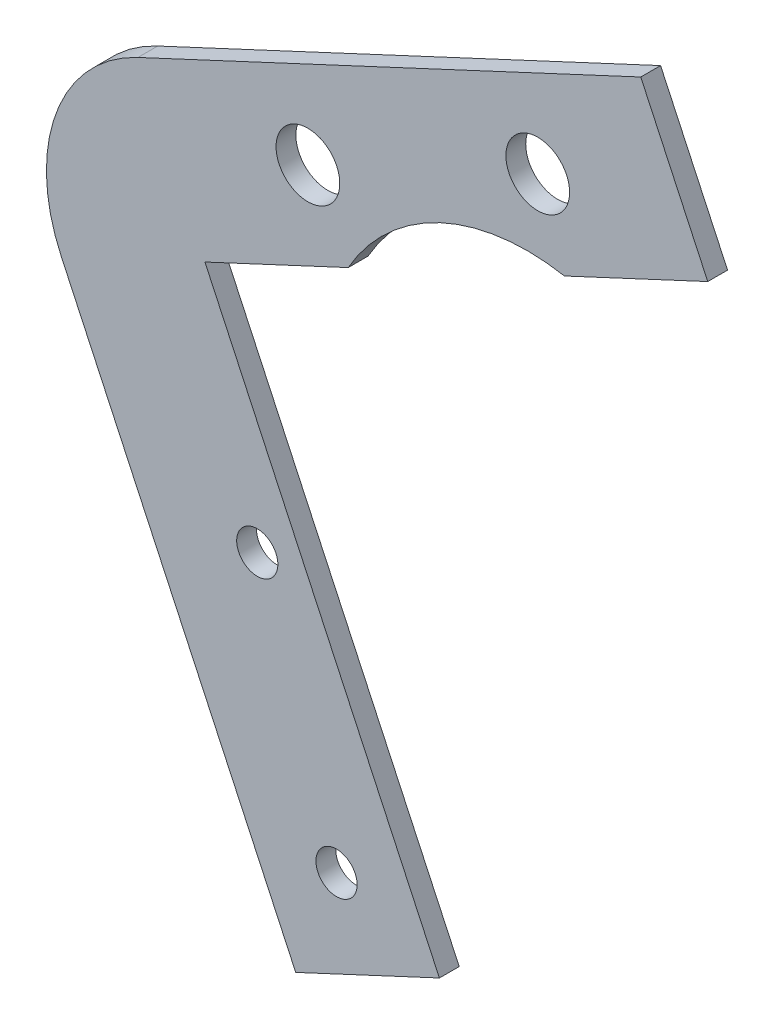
ISO-10303-21;
HEADER;
FILE_DESCRIPTION(('STEP AP214'),'2;1');
FILE_NAME('part.step','',(''),(''),'','','');
FILE_SCHEMA(('AUTOMOTIVE_DESIGN { 1 0 10303 214 1 1 1 1 }'));
ENDSEC;
DATA;
#1=APPLICATION_CONTEXT('core data for automotive mechanical design processes');
#2=APPLICATION_PROTOCOL_DEFINITION('international standard','automotive_design',2000,#1);
#3=PRODUCT_CONTEXT('',#1,'mechanical');
#4=PRODUCT('Part','Part','',(#3));
#5=PRODUCT_RELATED_PRODUCT_CATEGORY('part','',(#4));
#6=PRODUCT_DEFINITION_FORMATION('','',#4);
#7=PRODUCT_DEFINITION_CONTEXT('part definition',#1,'design');
#8=PRODUCT_DEFINITION('design','',#6,#7);
#9=PRODUCT_DEFINITION_SHAPE('','',#8);
#10=(LENGTH_UNIT() NAMED_UNIT(*) SI_UNIT(.MILLI.,.METRE.));
#11=(NAMED_UNIT(*) PLANE_ANGLE_UNIT() SI_UNIT($,.RADIAN.));
#12=(NAMED_UNIT(*) SI_UNIT($,.STERADIAN.) SOLID_ANGLE_UNIT());
#13=UNCERTAINTY_MEASURE_WITH_UNIT(LENGTH_MEASURE(1.E-05),#10,'distance_accuracy_value','');
#14=(GEOMETRIC_REPRESENTATION_CONTEXT(3) GLOBAL_UNCERTAINTY_ASSIGNED_CONTEXT((#13)) GLOBAL_UNIT_ASSIGNED_CONTEXT((#10,
#11,#12)) REPRESENTATION_CONTEXT('',''));
#15=CARTESIAN_POINT('',(0.,0.,0.));
#16=DIRECTION('',(0.,0.,1.));
#17=DIRECTION('',(1.,0.,0.));
#18=AXIS2_PLACEMENT_3D('',#15,#16,#17);
#19=CARTESIAN_POINT('',(24.8129176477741,37.4773565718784,1.58749999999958));
#20=DIRECTION('',(0.,0.,0.999999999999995));
#21=DIRECTION('',(0.999999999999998,0.,0.));
#22=AXIS2_PLACEMENT_3D('',#19,#20,#21);
#23=PLANE('',#22);
#24=CARTESIAN_POINT('',(25.6480917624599,59.726927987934,1.58750000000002));
#25=DIRECTION('',(0.,0.,0.999999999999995));
#26=DIRECTION('',(0.999999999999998,0.,0.));
#27=AXIS2_PLACEMENT_3D('',#24,#25,#26);
#28=CIRCLE('',#27,2.55269999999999);
#29=CARTESIAN_POINT('',(23.0953917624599,59.726927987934,1.58750000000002));
#30=VERTEX_POINT('',#29);
#31=EDGE_CURVE('E201',#30,#30,#28,.T.);
#32=ORIENTED_EDGE('',*,*,#31,.F.);
#33=EDGE_LOOP('',(#32));
#34=FACE_BOUND('',#33,.T.);
#35=CARTESIAN_POINT('',(3.17499999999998,22.2249999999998,1.58750000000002));
#36=DIRECTION('',(0.,0.,0.999999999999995));
#37=DIRECTION('',(0.999999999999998,0.,0.));
#38=AXIS2_PLACEMENT_3D('',#35,#36,#37);
#39=CIRCLE('',#38,1.651);
#40=CARTESIAN_POINT('',(1.52399999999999,22.2249999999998,1.58750000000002));
#41=VERTEX_POINT('',#40);
#42=EDGE_CURVE('E137',#41,#41,#39,.T.);
#43=ORIENTED_EDGE('',*,*,#42,.F.);
#44=EDGE_LOOP('',(#43));
#45=FACE_BOUND('',#44,.T.);
#46=DIRECTION('',(0.90630778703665,0.422618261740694,0.));
#47=VECTOR('',#46,1.);
#48=CARTESIAN_POINT('',(6.2562128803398,-5.36725192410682,1.58749999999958));
#49=LINE('',#48,#47);
#50=CARTESIAN_POINT('',(6.2562128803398,-5.36725192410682,1.58749999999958));
#51=VERTEX_POINT('',#50);
#52=CARTESIAN_POINT('',(17.7663217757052,0.,1.58749999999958));
#53=VERTEX_POINT('',#52);
#54=EDGE_CURVE('E150',#51,#53,#49,.T.);
#55=ORIENTED_EDGE('',*,*,#54,.T.);
#56=DIRECTION('',(-0.422618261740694,0.906307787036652,0.));
#57=VECTOR('',#56,1.);
#58=CARTESIAN_POINT('',(17.7663217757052,0.,1.58749999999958));
#59=LINE('',#58,#57);
#60=CARTESIAN_POINT('',(-1.01905995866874,40.2853811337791,1.58749999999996));
#61=VERTEX_POINT('',#60);
#62=EDGE_CURVE('E93',#53,#61,#59,.T.);
#63=ORIENTED_EDGE('',*,*,#62,.T.);
#64=DIRECTION('',(0.90630778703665,0.422618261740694,0.));
#65=VECTOR('',#64,1.);
#66=CARTESIAN_POINT('',(-1.01905995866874,40.2853811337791,1.58749999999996));
#67=LINE('',#66,#65);
#68=CARTESIAN_POINT('',(10.4611743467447,45.6387023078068,1.58749999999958));
#69=VERTEX_POINT('',#68);
#70=EDGE_CURVE('E168',#61,#69,#67,.T.);
#71=ORIENTED_EDGE('',*,*,#70,.T.);
#72=CARTESIAN_POINT('',(24.8129176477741,37.4773565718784,1.58749999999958));
#73=DIRECTION('',(0.,0.,-0.999999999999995));
#74=DIRECTION('',(0.999999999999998,0.,0.));
#75=AXIS2_PLACEMENT_3D('',#72,#73,#74);
#76=CIRCLE('',#75,16.51);
#77=CARTESIAN_POINT('',(27.7860868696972,53.7174416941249,1.58750000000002));
#78=VERTEX_POINT('',#77);
#79=EDGE_CURVE('E185',#69,#78,#76,.T.);
#80=ORIENTED_EDGE('',*,*,#79,.T.);
#81=DIRECTION('',(0.906307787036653,0.422618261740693,0.));
#82=VECTOR('',#81,1.);
#83=CARTESIAN_POINT('',(27.7860868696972,53.7174416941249,1.58750000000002));
#84=LINE('',#83,#82);
#85=CARTESIAN_POINT('',(39.2663211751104,59.0707628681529,1.58750000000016));
#86=VERTEX_POINT('',#85);
#87=EDGE_CURVE('E184',#78,#86,#84,.T.);
#88=ORIENTED_EDGE('',*,*,#87,.T.);
#89=DIRECTION('',(-0.422618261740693,0.906307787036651,0.));
#90=VECTOR('',#89,1.);
#91=CARTESIAN_POINT('',(39.2663211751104,59.0707628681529,1.58750000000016));
#92=LINE('',#91,#90);
#93=CARTESIAN_POINT('',(33.8990692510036,70.580871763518,1.5875000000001));
#94=VERTEX_POINT('',#93);
#95=EDGE_CURVE('E115',#86,#94,#92,.T.);
#96=ORIENTED_EDGE('',*,*,#95,.T.);
#97=DIRECTION('',(-0.90630778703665,-0.422618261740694,0.));
#98=VECTOR('',#97,1.);
#99=CARTESIAN_POINT('',(33.8990692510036,70.580871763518,1.5875000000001));
#100=LINE('',#99,#98);
#101=CARTESIAN_POINT('',(-6.38631188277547,51.7954900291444,1.58749999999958));
#102=VERTEX_POINT('',#101);
#103=EDGE_CURVE('E109',#94,#102,#100,.T.);
#104=ORIENTED_EDGE('',*,*,#103,.T.);
#105=CARTESIAN_POINT('',(-1.01905995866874,40.2853811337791,1.58749999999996));
#106=DIRECTION('',(0.,0.,0.999999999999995));
#107=DIRECTION('',(-0.999999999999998,0.,0.));
#108=AXIS2_PLACEMENT_3D('',#105,#106,#107);
#109=CIRCLE('',#108,12.7);
#110=CARTESIAN_POINT('',(-12.5291688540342,34.9181292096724,1.58750000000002));
#111=VERTEX_POINT('',#110);
#112=EDGE_CURVE('E113',#102,#111,#109,.T.);
#113=ORIENTED_EDGE('',*,*,#112,.T.);
#114=DIRECTION('',(0.422618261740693,-0.906307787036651,0.));
#115=VECTOR('',#114,1.);
#116=CARTESIAN_POINT('',(-12.5291688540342,34.9181292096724,1.58750000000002));
#117=LINE('',#116,#115);
#118=EDGE_CURVE('E47',#111,#51,#117,.T.);
#119=ORIENTED_EDGE('',*,*,#118,.T.);
#120=EDGE_LOOP('',(#55,#63,#71,#80,#88,#96,#104,#113,#119));
#121=FACE_BOUND('',#120,.T.);
#122=CARTESIAN_POINT('',(9.52499999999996,3.17499999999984,1.58749999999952));
#123=DIRECTION('',(0.,0.,0.999999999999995));
#124=DIRECTION('',(0.999999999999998,0.,0.));
#125=AXIS2_PLACEMENT_3D('',#122,#123,#124);
#126=CIRCLE('',#125,1.651);
#127=CARTESIAN_POINT('',(7.87399999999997,3.17499999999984,1.58749999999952));
#128=VERTEX_POINT('',#127);
#129=EDGE_CURVE('E195',#128,#128,#126,.T.);
#130=ORIENTED_EDGE('',*,*,#129,.F.);
#131=EDGE_LOOP('',(#130));
#132=FACE_BOUND('',#131,.T.);
#133=CARTESIAN_POINT('',(7.23191752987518,51.1393249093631,1.58749999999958));
#134=DIRECTION('',(0.,0.,0.999999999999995));
#135=DIRECTION('',(0.999999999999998,0.,0.));
#136=AXIS2_PLACEMENT_3D('',#133,#134,#135);
#137=CIRCLE('',#136,2.55270000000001);
#138=CARTESIAN_POINT('',(4.67921752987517,51.1393249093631,1.58749999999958));
#139=VERTEX_POINT('',#138);
#140=EDGE_CURVE('E207',#139,#139,#137,.T.);
#141=ORIENTED_EDGE('',*,*,#140,.F.);
#142=EDGE_LOOP('',(#141));
#143=FACE_BOUND('',#142,.T.);
#144=ADVANCED_FACE('F30',(#34,#45,#121,#132,#143),#23,.T.);
#145=CARTESIAN_POINT('',(24.8129176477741,37.4773565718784,-4.44089209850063E-13));
#146=DIRECTION('',(0.,0.,0.999999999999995));
#147=DIRECTION('',(0.999999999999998,0.,0.));
#148=AXIS2_PLACEMENT_3D('',#145,#146,#147);
#149=PLANE('',#148);
#150=CARTESIAN_POINT('',(25.6480917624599,59.726927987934,1.94289029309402E-13));
#151=DIRECTION('',(0.,0.,0.999999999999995));
#152=DIRECTION('',(0.999999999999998,0.,0.));
#153=AXIS2_PLACEMENT_3D('',#150,#151,#152);
#154=CIRCLE('',#153,2.55269999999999);
#155=CARTESIAN_POINT('',(23.0953917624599,59.726927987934,1.94289029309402E-13));
#156=VERTEX_POINT('',#155);
#157=EDGE_CURVE('E204',#156,#156,#154,.T.);
#158=ORIENTED_EDGE('',*,*,#157,.T.);
#159=EDGE_LOOP('',(#158));
#160=FACE_BOUND('',#159,.T.);
#161=CARTESIAN_POINT('',(3.17500000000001,22.2249999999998,0.));
#162=DIRECTION('',(0.,0.,0.999999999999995));
#163=DIRECTION('',(0.999999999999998,0.,0.));
#164=AXIS2_PLACEMENT_3D('',#161,#162,#163);
#165=CIRCLE('',#164,1.651);
#166=CARTESIAN_POINT('',(1.52399999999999,22.2249999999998,0.));
#167=VERTEX_POINT('',#166);
#168=EDGE_CURVE('E192',#167,#167,#165,.T.);
#169=ORIENTED_EDGE('',*,*,#168,.T.);
#170=EDGE_LOOP('',(#169));
#171=FACE_BOUND('',#170,.T.);
#172=DIRECTION('',(0.90630778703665,0.422618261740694,0.));
#173=VECTOR('',#172,1.);
#174=CARTESIAN_POINT('',(6.2562128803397,-5.36725192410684,-4.44089209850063E-13));
#175=LINE('',#174,#173);
#176=CARTESIAN_POINT('',(6.2562128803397,-5.36725192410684,-4.44089209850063E-13));
#177=VERTEX_POINT('',#176);
#178=CARTESIAN_POINT('',(17.7663217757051,0.,-4.44089209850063E-13));
#179=VERTEX_POINT('',#178);
#180=EDGE_CURVE('E133',#177,#179,#175,.T.);
#181=ORIENTED_EDGE('',*,*,#180,.F.);
#182=DIRECTION('',(0.422618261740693,-0.906307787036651,0.));
#183=VECTOR('',#182,1.);
#184=CARTESIAN_POINT('',(-12.529168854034,34.9181292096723,0.));
#185=LINE('',#184,#183);
#186=CARTESIAN_POINT('',(-12.529168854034,34.9181292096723,0.));
#187=VERTEX_POINT('',#186);
#188=EDGE_CURVE('E85',#187,#177,#185,.T.);
#189=ORIENTED_EDGE('',*,*,#188,.F.);
#190=CARTESIAN_POINT('',(-1.01905995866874,40.2853811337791,0.));
#191=DIRECTION('',(0.,0.,0.999999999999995));
#192=DIRECTION('',(-0.999999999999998,0.,0.));
#193=AXIS2_PLACEMENT_3D('',#190,#191,#192);
#194=CIRCLE('',#193,12.7);
#195=CARTESIAN_POINT('',(-6.38631188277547,51.7954900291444,-4.44089209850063E-13));
#196=VERTEX_POINT('',#195);
#197=EDGE_CURVE('E79',#196,#187,#194,.T.);
#198=ORIENTED_EDGE('',*,*,#197,.F.);
#199=DIRECTION('',(-0.90630778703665,-0.422618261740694,0.));
#200=VECTOR('',#199,1.);
#201=CARTESIAN_POINT('',(33.8990692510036,70.580871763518,0.));
#202=LINE('',#201,#200);
#203=CARTESIAN_POINT('',(33.8990692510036,70.580871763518,0.));
#204=VERTEX_POINT('',#203);
#205=EDGE_CURVE('E123',#204,#196,#202,.T.);
#206=ORIENTED_EDGE('',*,*,#205,.F.);
#207=DIRECTION('',(-0.422618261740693,0.906307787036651,0.));
#208=VECTOR('',#207,1.);
#209=CARTESIAN_POINT('',(39.2663211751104,59.0707628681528,1.94289029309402E-13));
#210=LINE('',#209,#208);
#211=CARTESIAN_POINT('',(39.2663211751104,59.0707628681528,1.94289029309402E-13));
#212=VERTEX_POINT('',#211);
#213=EDGE_CURVE('E145',#212,#204,#210,.T.);
#214=ORIENTED_EDGE('',*,*,#213,.F.);
#215=DIRECTION('',(0.906307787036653,0.422618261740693,0.));
#216=VECTOR('',#215,1.);
#217=CARTESIAN_POINT('',(27.7860868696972,53.7174416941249,0.));
#218=LINE('',#217,#216);
#219=CARTESIAN_POINT('',(27.7860868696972,53.7174416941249,0.));
#220=VERTEX_POINT('',#219);
#221=EDGE_CURVE('E143',#220,#212,#218,.T.);
#222=ORIENTED_EDGE('',*,*,#221,.F.);
#223=CARTESIAN_POINT('',(24.8129176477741,37.4773565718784,-4.44089209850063E-13));
#224=DIRECTION('',(0.,0.,-0.999999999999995));
#225=DIRECTION('',(0.999999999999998,0.,0.));
#226=AXIS2_PLACEMENT_3D('',#223,#224,#225);
#227=CIRCLE('',#226,16.51);
#228=CARTESIAN_POINT('',(10.4611743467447,45.6387023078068,-4.44089209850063E-13));
#229=VERTEX_POINT('',#228);
#230=EDGE_CURVE('E141',#229,#220,#227,.T.);
#231=ORIENTED_EDGE('',*,*,#230,.F.);
#232=DIRECTION('',(0.90630778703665,0.422618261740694,0.));
#233=VECTOR('',#232,1.);
#234=CARTESIAN_POINT('',(-1.01905995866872,40.2853811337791,0.));
#235=LINE('',#234,#233);
#236=CARTESIAN_POINT('',(-1.01905995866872,40.2853811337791,0.));
#237=VERTEX_POINT('',#236);
#238=EDGE_CURVE('E139',#237,#229,#235,.T.);
#239=ORIENTED_EDGE('',*,*,#238,.F.);
#240=DIRECTION('',(-0.422618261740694,0.906307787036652,0.));
#241=VECTOR('',#240,1.);
#242=CARTESIAN_POINT('',(17.7663217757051,0.,-4.44089209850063E-13));
#243=LINE('',#242,#241);
#244=EDGE_CURVE('E136',#179,#237,#243,.T.);
#245=ORIENTED_EDGE('',*,*,#244,.F.);
#246=EDGE_LOOP('',(#181,#189,#198,#206,#214,#222,#231,#239,#245));
#247=FACE_BOUND('',#246,.T.);
#248=CARTESIAN_POINT('',(9.52499999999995,3.17499999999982,-4.44089209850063E-13));
#249=DIRECTION('',(0.,0.,0.999999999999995));
#250=DIRECTION('',(0.999999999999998,0.,0.));
#251=AXIS2_PLACEMENT_3D('',#248,#249,#250);
#252=CIRCLE('',#251,1.651);
#253=CARTESIAN_POINT('',(7.87399999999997,3.17499999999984,-4.44089209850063E-13));
#254=VERTEX_POINT('',#253);
#255=EDGE_CURVE('E198',#254,#254,#252,.T.);
#256=ORIENTED_EDGE('',*,*,#255,.T.);
#257=EDGE_LOOP('',(#256));
#258=FACE_BOUND('',#257,.T.);
#259=CARTESIAN_POINT('',(7.23191752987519,51.1393249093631,-4.44089209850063E-13));
#260=DIRECTION('',(0.,0.,0.999999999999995));
#261=DIRECTION('',(0.999999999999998,0.,0.));
#262=AXIS2_PLACEMENT_3D('',#259,#260,#261);
#263=CIRCLE('',#262,2.55270000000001);
#264=CARTESIAN_POINT('',(4.67921752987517,51.1393249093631,-4.44089209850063E-13));
#265=VERTEX_POINT('',#264);
#266=EDGE_CURVE('E210',#265,#265,#263,.T.);
#267=ORIENTED_EDGE('',*,*,#266,.T.);
#268=EDGE_LOOP('',(#267));
#269=FACE_BOUND('',#268,.T.);
#270=ADVANCED_FACE('F172',(#160,#171,#247,#258,#269),#149,.F.);
#271=CARTESIAN_POINT('',(6.2562128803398,-5.36725192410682,1.58749999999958));
#272=DIRECTION('',(-0.422618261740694,0.90630778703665,0.));
#273=DIRECTION('',(-0.90630778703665,-0.422618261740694,0.));
#274=AXIS2_PLACEMENT_3D('',#271,#272,#273);
#275=PLANE('',#274);
#276=ORIENTED_EDGE('',*,*,#180,.T.);
#277=DIRECTION('',(0.,0.,-0.999999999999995));
#278=VECTOR('',#277,1.);
#279=CARTESIAN_POINT('',(17.7663217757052,0.,1.58749999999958));
#280=LINE('',#279,#278);
#281=EDGE_CURVE('E11',#53,#179,#280,.T.);
#282=ORIENTED_EDGE('',*,*,#281,.F.);
#283=ORIENTED_EDGE('',*,*,#54,.F.);
#284=DIRECTION('',(0.,0.,-0.999999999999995));
#285=VECTOR('',#284,1.);
#286=CARTESIAN_POINT('',(6.2562128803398,-5.36725192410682,1.58749999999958));
#287=LINE('',#286,#285);
#288=EDGE_CURVE('E129',#51,#177,#287,.T.);
#289=ORIENTED_EDGE('',*,*,#288,.T.);
#290=EDGE_LOOP('',(#276,#282,#283,#289));
#291=FACE_BOUND('',#290,.T.);
#292=ADVANCED_FACE('F32',(#291),#275,.F.);
#293=CARTESIAN_POINT('',(17.7663217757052,0.,1.58749999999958));
#294=DIRECTION('',(-0.906307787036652,-0.422618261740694,0.));
#295=DIRECTION('',(0.422618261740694,-0.906307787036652,0.));
#296=AXIS2_PLACEMENT_3D('',#293,#294,#295);
#297=PLANE('',#296);
#298=ORIENTED_EDGE('',*,*,#244,.T.);
#299=DIRECTION('',(0.,0.,-0.999999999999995));
#300=VECTOR('',#299,1.);
#301=CARTESIAN_POINT('',(-1.01905995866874,40.2853811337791,1.58749999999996));
#302=LINE('',#301,#300);
#303=EDGE_CURVE('E39',#61,#237,#302,.T.);
#304=ORIENTED_EDGE('',*,*,#303,.F.);
#305=ORIENTED_EDGE('',*,*,#62,.F.);
#306=ORIENTED_EDGE('',*,*,#281,.T.);
#307=EDGE_LOOP('',(#298,#304,#305,#306));
#308=FACE_BOUND('',#307,.T.);
#309=ADVANCED_FACE('F249',(#308),#297,.F.);
#310=CARTESIAN_POINT('',(-1.01905995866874,40.2853811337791,1.58749999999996));
#311=DIRECTION('',(-0.422618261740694,0.90630778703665,0.));
#312=DIRECTION('',(-0.90630778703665,-0.422618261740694,0.));
#313=AXIS2_PLACEMENT_3D('',#310,#311,#312);
#314=PLANE('',#313);
#315=ORIENTED_EDGE('',*,*,#238,.T.);
#316=DIRECTION('',(0.,0.,-0.999999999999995));
#317=VECTOR('',#316,1.);
#318=CARTESIAN_POINT('',(10.4611743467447,45.6387023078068,1.58749999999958));
#319=LINE('',#318,#317);
#320=EDGE_CURVE('E160',#69,#229,#319,.T.);
#321=ORIENTED_EDGE('',*,*,#320,.F.);
#322=ORIENTED_EDGE('',*,*,#70,.F.);
#323=ORIENTED_EDGE('',*,*,#303,.T.);
#324=EDGE_LOOP('',(#315,#321,#322,#323));
#325=FACE_BOUND('',#324,.T.);
#326=ADVANCED_FACE('F166',(#325),#314,.F.);
#327=CARTESIAN_POINT('',(24.8129176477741,37.4773565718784,1.58749999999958));
#328=DIRECTION('',(0.,0.,-0.999999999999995));
#329=DIRECTION('',(-0.999999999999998,0.,0.));
#330=AXIS2_PLACEMENT_3D('',#327,#328,#329);
#331=CYLINDRICAL_SURFACE('',#330,16.51);
#332=ORIENTED_EDGE('',*,*,#230,.T.);
#333=DIRECTION('',(0.,0.,-0.999999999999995));
#334=VECTOR('',#333,1.);
#335=CARTESIAN_POINT('',(27.7860868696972,53.7174416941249,1.58750000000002));
#336=LINE('',#335,#334);
#337=EDGE_CURVE('E157',#78,#220,#336,.T.);
#338=ORIENTED_EDGE('',*,*,#337,.F.);
#339=ORIENTED_EDGE('',*,*,#79,.F.);
#340=ORIENTED_EDGE('',*,*,#320,.T.);
#341=EDGE_LOOP('',(#332,#338,#339,#340));
#342=FACE_BOUND('',#341,.T.);
#343=ADVANCED_FACE('F178',(#342),#331,.F.);
#344=CARTESIAN_POINT('',(27.7860868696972,53.7174416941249,1.58750000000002));
#345=DIRECTION('',(-0.422618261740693,0.906307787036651,0.));
#346=DIRECTION('',(-0.906307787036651,-0.422618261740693,0.));
#347=AXIS2_PLACEMENT_3D('',#344,#345,#346);
#348=PLANE('',#347);
#349=ORIENTED_EDGE('',*,*,#221,.T.);
#350=DIRECTION('',(0.,0.,-0.999999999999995));
#351=VECTOR('',#350,1.);
#352=CARTESIAN_POINT('',(39.2663211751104,59.0707628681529,1.58750000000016));
#353=LINE('',#352,#351);
#354=EDGE_CURVE('E154',#86,#212,#353,.T.);
#355=ORIENTED_EDGE('',*,*,#354,.F.);
#356=ORIENTED_EDGE('',*,*,#87,.F.);
#357=ORIENTED_EDGE('',*,*,#337,.T.);
#358=EDGE_LOOP('',(#349,#355,#356,#357));
#359=FACE_BOUND('',#358,.T.);
#360=ADVANCED_FACE('F182',(#359),#348,.F.);
#361=CARTESIAN_POINT('',(39.2663211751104,59.0707628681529,1.58750000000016));
#362=DIRECTION('',(-0.906307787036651,-0.422618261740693,0.));
#363=DIRECTION('',(0.422618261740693,-0.906307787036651,0.));
#364=AXIS2_PLACEMENT_3D('',#361,#362,#363);
#365=PLANE('',#364);
#366=ORIENTED_EDGE('',*,*,#213,.T.);
#367=DIRECTION('',(0.,0.,-0.999999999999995));
#368=VECTOR('',#367,1.);
#369=CARTESIAN_POINT('',(33.8990692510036,70.580871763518,1.5875000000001));
#370=LINE('',#369,#368);
#371=EDGE_CURVE('E124',#94,#204,#370,.T.);
#372=ORIENTED_EDGE('',*,*,#371,.F.);
#373=ORIENTED_EDGE('',*,*,#95,.F.);
#374=ORIENTED_EDGE('',*,*,#354,.T.);
#375=EDGE_LOOP('',(#366,#372,#373,#374));
#376=FACE_BOUND('',#375,.T.);
#377=ADVANCED_FACE('F240',(#376),#365,.F.);
#378=CARTESIAN_POINT('',(33.8990692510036,70.580871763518,1.5875000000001));
#379=DIRECTION('',(0.422618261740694,-0.90630778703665,0.));
#380=DIRECTION('',(0.90630778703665,0.422618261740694,0.));
#381=AXIS2_PLACEMENT_3D('',#378,#379,#380);
#382=PLANE('',#381);
#383=ORIENTED_EDGE('',*,*,#205,.T.);
#384=DIRECTION('',(0.,0.,-0.999999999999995));
#385=VECTOR('',#384,1.);
#386=CARTESIAN_POINT('',(-6.38631188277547,51.7954900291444,1.58749999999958));
#387=LINE('',#386,#385);
#388=EDGE_CURVE('E120',#102,#196,#387,.T.);
#389=ORIENTED_EDGE('',*,*,#388,.F.);
#390=ORIENTED_EDGE('',*,*,#103,.F.);
#391=ORIENTED_EDGE('',*,*,#371,.T.);
#392=EDGE_LOOP('',(#383,#389,#390,#391));
#393=FACE_BOUND('',#392,.T.);
#394=ADVANCED_FACE('F121',(#393),#382,.F.);
#395=CARTESIAN_POINT('',(-1.01905995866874,40.2853811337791,1.58749999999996));
#396=DIRECTION('',(0.,0.,-0.999999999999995));
#397=DIRECTION('',(-0.999999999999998,0.,0.));
#398=AXIS2_PLACEMENT_3D('',#395,#396,#397);
#399=CYLINDRICAL_SURFACE('',#398,12.7);
#400=ORIENTED_EDGE('',*,*,#197,.T.);
#401=DIRECTION('',(0.,0.,-0.999999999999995));
#402=VECTOR('',#401,1.);
#403=CARTESIAN_POINT('',(-12.5291688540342,34.9181292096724,1.58750000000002));
#404=LINE('',#403,#402);
#405=EDGE_CURVE('E125',#111,#187,#404,.T.);
#406=ORIENTED_EDGE('',*,*,#405,.F.);
#407=ORIENTED_EDGE('',*,*,#112,.F.);
#408=ORIENTED_EDGE('',*,*,#388,.T.);
#409=EDGE_LOOP('',(#400,#406,#407,#408));
#410=FACE_BOUND('',#409,.T.);
#411=ADVANCED_FACE('F127',(#410),#399,.T.);
#412=CARTESIAN_POINT('',(-12.5291688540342,34.9181292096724,1.58750000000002));
#413=DIRECTION('',(0.906307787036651,0.422618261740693,0.));
#414=DIRECTION('',(-0.422618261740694,0.906307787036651,0.));
#415=AXIS2_PLACEMENT_3D('',#412,#413,#414);
#416=PLANE('',#415);
#417=ORIENTED_EDGE('',*,*,#188,.T.);
#418=ORIENTED_EDGE('',*,*,#288,.F.);
#419=ORIENTED_EDGE('',*,*,#118,.F.);
#420=ORIENTED_EDGE('',*,*,#405,.T.);
#421=EDGE_LOOP('',(#417,#418,#419,#420));
#422=FACE_BOUND('',#421,.T.);
#423=ADVANCED_FACE('F233',(#422),#416,.F.);
#424=CARTESIAN_POINT('',(3.17499999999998,22.2249999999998,1.58750000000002));
#425=DIRECTION('',(0.,0.,-0.999999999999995));
#426=DIRECTION('',(-0.999999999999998,0.,0.));
#427=AXIS2_PLACEMENT_3D('',#424,#425,#426);
#428=CYLINDRICAL_SURFACE('',#427,1.651);
#429=CARTESIAN_POINT('',(1.52399999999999,22.2249999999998,1.58750000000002));
#430=CARTESIAN_POINT('',(1.52399999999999,22.2249999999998,1.57096354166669));
#431=CARTESIAN_POINT('',(1.52399999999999,22.2249999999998,1.55442708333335));
#432=CARTESIAN_POINT('',(1.52399999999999,22.2249999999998,1.52135416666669));
#433=CARTESIAN_POINT('',(1.52399999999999,22.2249999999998,1.50481770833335));
#434=CARTESIAN_POINT('',(1.52399999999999,22.2249999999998,1.47174479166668));
#435=CARTESIAN_POINT('',(1.52399999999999,22.2249999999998,1.45520833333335));
#436=CARTESIAN_POINT('',(1.52399999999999,22.2249999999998,1.42213541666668));
#437=CARTESIAN_POINT('',(1.52399999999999,22.2249999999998,1.40559895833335));
#438=CARTESIAN_POINT('',(1.52399999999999,22.2249999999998,1.37252604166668));
#439=CARTESIAN_POINT('',(1.52399999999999,22.2249999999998,1.35598958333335));
#440=CARTESIAN_POINT('',(1.52399999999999,22.2249999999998,1.32291666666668));
#441=CARTESIAN_POINT('',(1.52399999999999,22.2249999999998,1.30638020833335));
#442=CARTESIAN_POINT('',(1.52399999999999,22.2249999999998,1.27330729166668));
#443=CARTESIAN_POINT('',(1.52399999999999,22.2249999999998,1.25677083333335));
#444=CARTESIAN_POINT('',(1.52399999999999,22.2249999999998,1.22369791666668));
#445=CARTESIAN_POINT('',(1.52399999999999,22.2249999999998,1.20716145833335));
#446=CARTESIAN_POINT('',(1.52399999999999,22.2249999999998,1.17408854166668));
#447=CARTESIAN_POINT('',(1.52399999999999,22.2249999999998,1.15755208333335));
#448=CARTESIAN_POINT('',(1.52399999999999,22.2249999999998,1.12447916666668));
#449=CARTESIAN_POINT('',(1.52399999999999,22.2249999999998,1.10794270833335));
#450=CARTESIAN_POINT('',(1.52399999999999,22.2249999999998,1.07486979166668));
#451=CARTESIAN_POINT('',(1.52399999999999,22.2249999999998,1.05833333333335));
#452=CARTESIAN_POINT('',(1.52399999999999,22.2249999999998,1.02526041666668));
#453=CARTESIAN_POINT('',(1.52399999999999,22.2249999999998,1.00872395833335));
#454=CARTESIAN_POINT('',(1.52399999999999,22.2249999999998,0.975651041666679));
#455=CARTESIAN_POINT('',(1.52399999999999,22.2249999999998,0.959114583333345));
#456=CARTESIAN_POINT('',(1.52399999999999,22.2249999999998,0.926041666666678));
#457=CARTESIAN_POINT('',(1.52399999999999,22.2249999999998,0.909505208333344));
#458=CARTESIAN_POINT('',(1.52399999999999,22.2249999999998,0.876432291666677));
#459=CARTESIAN_POINT('',(1.52399999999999,22.2249999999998,0.859895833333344));
#460=CARTESIAN_POINT('',(1.52399999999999,22.2249999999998,0.826822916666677));
#461=CARTESIAN_POINT('',(1.52399999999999,22.2249999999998,0.810286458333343));
#462=CARTESIAN_POINT('',(1.52399999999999,22.2249999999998,0.777213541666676));
#463=CARTESIAN_POINT('',(1.52399999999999,22.2249999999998,0.760677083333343));
#464=CARTESIAN_POINT('',(1.52399999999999,22.2249999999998,0.727604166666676));
#465=CARTESIAN_POINT('',(1.52399999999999,22.2249999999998,0.711067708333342));
#466=CARTESIAN_POINT('',(1.52399999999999,22.2249999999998,0.677994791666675));
#467=CARTESIAN_POINT('',(1.52399999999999,22.2249999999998,0.661458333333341));
#468=CARTESIAN_POINT('',(1.52399999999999,22.2249999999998,0.628385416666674));
#469=CARTESIAN_POINT('',(1.52399999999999,22.2249999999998,0.611848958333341));
#470=CARTESIAN_POINT('',(1.52399999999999,22.2249999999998,0.578776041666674));
#471=CARTESIAN_POINT('',(1.52399999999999,22.2249999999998,0.56223958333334));
#472=CARTESIAN_POINT('',(1.52399999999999,22.2249999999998,0.529166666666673));
#473=CARTESIAN_POINT('',(1.52399999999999,22.2249999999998,0.51263020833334));
#474=CARTESIAN_POINT('',(1.52399999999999,22.2249999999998,0.479557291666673));
#475=CARTESIAN_POINT('',(1.52399999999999,22.2249999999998,0.463020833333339));
#476=CARTESIAN_POINT('',(1.52399999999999,22.2249999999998,0.429947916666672));
#477=CARTESIAN_POINT('',(1.52399999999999,22.2249999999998,0.413411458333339));
#478=CARTESIAN_POINT('',(1.52399999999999,22.2249999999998,0.380338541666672));
#479=CARTESIAN_POINT('',(1.52399999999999,22.2249999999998,0.363802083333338));
#480=CARTESIAN_POINT('',(1.52399999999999,22.2249999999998,0.330729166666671));
#481=CARTESIAN_POINT('',(1.52399999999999,22.2249999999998,0.314192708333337));
#482=CARTESIAN_POINT('',(1.52399999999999,22.2249999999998,0.28111979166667));
#483=CARTESIAN_POINT('',(1.52399999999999,22.2249999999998,0.264583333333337));
#484=CARTESIAN_POINT('',(1.52399999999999,22.2249999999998,0.231510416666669));
#485=CARTESIAN_POINT('',(1.52399999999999,22.2249999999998,0.214973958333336));
#486=CARTESIAN_POINT('',(1.52399999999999,22.2249999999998,0.181901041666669));
#487=CARTESIAN_POINT('',(1.52399999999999,22.2249999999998,0.165364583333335));
#488=CARTESIAN_POINT('',(1.52399999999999,22.2249999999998,0.132291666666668));
#489=CARTESIAN_POINT('',(1.52399999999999,22.2249999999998,0.115755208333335));
#490=CARTESIAN_POINT('',(1.52399999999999,22.2249999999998,0.0826822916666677));
#491=CARTESIAN_POINT('',(1.52399999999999,22.2249999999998,0.0661458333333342));
#492=CARTESIAN_POINT('',(1.52399999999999,22.2249999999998,0.0330729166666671));
#493=CARTESIAN_POINT('',(1.52399999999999,22.2249999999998,0.0165364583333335));
#494=CARTESIAN_POINT('',(1.52399999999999,22.2249999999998,0.));
#495=B_SPLINE_CURVE_WITH_KNOTS('',3,(#429,#430,#431,#432,#433,#434,#435,#436,#437,#438,#439,
#440,#441,#442,#443,#444,#445,#446,#447,#448,#449,#450,#451,#452,#453,#454,#455,#456,#457,#458,
#459,#460,#461,#462,#463,#464,#465,#466,#467,#468,#469,#470,#471,#472,#473,#474,#475,#476,#477,
#478,#479,#480,#481,#482,#483,#484,#485,#486,#487,#488,#489,#490,#491,#492,#493,#494),
.UNSPECIFIED.,.F.,.F.,(4,2,2,2,2,2,2,2,2,2,2,2,2,2,2,2,2,2,2,2,2,2,2,2,2,2,2,2,2,2,2,2,4),(0.,
0.0496093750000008,0.0992187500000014,0.148828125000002,0.198437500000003,0.248046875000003,
0.297656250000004,0.347265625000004,0.396875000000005,0.446484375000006,0.496093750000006,
0.545703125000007,0.595312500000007,0.644921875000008,0.694531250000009,0.744140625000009,
0.79375000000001,0.843359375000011,0.892968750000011,0.942578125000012,0.992187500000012,
1.04179687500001,1.09140625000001,1.14101562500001,1.19062500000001,1.24023437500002,
1.28984375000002,1.33945312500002,1.38906250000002,1.43867187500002,1.48828125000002,
1.53789062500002,1.58750000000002),.UNSPECIFIED.);
#496=EDGE_CURVE('BSEAM230',#41,#167,#495,.T.);
#497=ORIENTED_EDGE('',*,*,#42,.T.);
#498=ORIENTED_EDGE('',*,*,#168,.F.);
#499=ORIENTED_EDGE('',*,*,#496,.T.);
#500=ORIENTED_EDGE('',*,*,#496,.F.);
#501=EDGE_LOOP('',(#497,#499,#498,#500));
#502=FACE_BOUND('',#501,.T.);
#503=ADVANCED_FACE('F230',(#502),#428,.F.);
#504=CARTESIAN_POINT('',(9.52499999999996,3.17499999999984,1.58749999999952));
#505=DIRECTION('',(0.,0.,-0.999999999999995));
#506=DIRECTION('',(-0.999999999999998,0.,0.));
#507=AXIS2_PLACEMENT_3D('',#504,#505,#506);
#508=CYLINDRICAL_SURFACE('',#507,1.651);
#509=CARTESIAN_POINT('',(7.87399999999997,3.17499999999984,1.58749999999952));
#510=CARTESIAN_POINT('',(7.87399999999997,3.17499999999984,1.57096354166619));
#511=CARTESIAN_POINT('',(7.87399999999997,3.17499999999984,1.55442708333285));
#512=CARTESIAN_POINT('',(7.87399999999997,3.17499999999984,1.52135416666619));
#513=CARTESIAN_POINT('',(7.87399999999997,3.17499999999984,1.50481770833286));
#514=CARTESIAN_POINT('',(7.87399999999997,3.17499999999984,1.47174479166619));
#515=CARTESIAN_POINT('',(7.87399999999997,3.17499999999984,1.45520833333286));
#516=CARTESIAN_POINT('',(7.87399999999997,3.17499999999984,1.42213541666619));
#517=CARTESIAN_POINT('',(7.87399999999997,3.17499999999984,1.40559895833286));
#518=CARTESIAN_POINT('',(7.87399999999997,3.17499999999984,1.37252604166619));
#519=CARTESIAN_POINT('',(7.87399999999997,3.17499999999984,1.35598958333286));
#520=CARTESIAN_POINT('',(7.87399999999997,3.17499999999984,1.32291666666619));
#521=CARTESIAN_POINT('',(7.87399999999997,3.17499999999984,1.30638020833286));
#522=CARTESIAN_POINT('',(7.87399999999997,3.17499999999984,1.27330729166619));
#523=CARTESIAN_POINT('',(7.87399999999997,3.17499999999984,1.25677083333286));
#524=CARTESIAN_POINT('',(7.87399999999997,3.17499999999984,1.22369791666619));
#525=CARTESIAN_POINT('',(7.87399999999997,3.17499999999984,1.20716145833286));
#526=CARTESIAN_POINT('',(7.87399999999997,3.17499999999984,1.1740885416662));
#527=CARTESIAN_POINT('',(7.87399999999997,3.17499999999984,1.15755208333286));
#528=CARTESIAN_POINT('',(7.87399999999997,3.17499999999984,1.1244791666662));
#529=CARTESIAN_POINT('',(7.87399999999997,3.17499999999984,1.10794270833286));
#530=CARTESIAN_POINT('',(7.87399999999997,3.17499999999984,1.0748697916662));
#531=CARTESIAN_POINT('',(7.87399999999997,3.17499999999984,1.05833333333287));
#532=CARTESIAN_POINT('',(7.87399999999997,3.17499999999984,1.0252604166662));
#533=CARTESIAN_POINT('',(7.87399999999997,3.17499999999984,1.00872395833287));
#534=CARTESIAN_POINT('',(7.87399999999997,3.17499999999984,0.9756510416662));
#535=CARTESIAN_POINT('',(7.87399999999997,3.17499999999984,0.959114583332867));
#536=CARTESIAN_POINT('',(7.87399999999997,3.17499999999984,0.926041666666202));
#537=CARTESIAN_POINT('',(7.87399999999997,3.17499999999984,0.909505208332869));
#538=CARTESIAN_POINT('',(7.87399999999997,3.17499999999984,0.876432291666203));
#539=CARTESIAN_POINT('',(7.87399999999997,3.17499999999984,0.85989583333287));
#540=CARTESIAN_POINT('',(7.87399999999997,3.17499999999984,0.826822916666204));
#541=CARTESIAN_POINT('',(7.87399999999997,3.17499999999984,0.810286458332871));
#542=CARTESIAN_POINT('',(7.87399999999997,3.17499999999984,0.777213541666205));
#543=CARTESIAN_POINT('',(7.87399999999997,3.17499999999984,0.760677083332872));
#544=CARTESIAN_POINT('',(7.87399999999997,3.17499999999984,0.727604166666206));
#545=CARTESIAN_POINT('',(7.87399999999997,3.17499999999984,0.711067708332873));
#546=CARTESIAN_POINT('',(7.87399999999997,3.17499999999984,0.677994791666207));
#547=CARTESIAN_POINT('',(7.87399999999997,3.17499999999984,0.661458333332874));
#548=CARTESIAN_POINT('',(7.87399999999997,3.17499999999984,0.628385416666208));
#549=CARTESIAN_POINT('',(7.87399999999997,3.17499999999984,0.611848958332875));
#550=CARTESIAN_POINT('',(7.87399999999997,3.17499999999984,0.578776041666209));
#551=CARTESIAN_POINT('',(7.87399999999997,3.17499999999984,0.562239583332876));
#552=CARTESIAN_POINT('',(7.87399999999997,3.17499999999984,0.529166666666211));
#553=CARTESIAN_POINT('',(7.87399999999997,3.17499999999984,0.512630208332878));
#554=CARTESIAN_POINT('',(7.87399999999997,3.17499999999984,0.479557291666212));
#555=CARTESIAN_POINT('',(7.87399999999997,3.17499999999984,0.463020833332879));
#556=CARTESIAN_POINT('',(7.87399999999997,3.17499999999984,0.429947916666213));
#557=CARTESIAN_POINT('',(7.87399999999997,3.17499999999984,0.41341145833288));
#558=CARTESIAN_POINT('',(7.87399999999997,3.17499999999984,0.380338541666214));
#559=CARTESIAN_POINT('',(7.87399999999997,3.17499999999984,0.363802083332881));
#560=CARTESIAN_POINT('',(7.87399999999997,3.17499999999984,0.330729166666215));
#561=CARTESIAN_POINT('',(7.87399999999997,3.17499999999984,0.314192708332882));
#562=CARTESIAN_POINT('',(7.87399999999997,3.17499999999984,0.281119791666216));
#563=CARTESIAN_POINT('',(7.87399999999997,3.17499999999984,0.264583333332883));
#564=CARTESIAN_POINT('',(7.87399999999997,3.17499999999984,0.231510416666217));
#565=CARTESIAN_POINT('',(7.87399999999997,3.17499999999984,0.214973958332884));
#566=CARTESIAN_POINT('',(7.87399999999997,3.17499999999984,0.181901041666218));
#567=CARTESIAN_POINT('',(7.87399999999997,3.17499999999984,0.165364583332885));
#568=CARTESIAN_POINT('',(7.87399999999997,3.17499999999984,0.13229166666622));
#569=CARTESIAN_POINT('',(7.87399999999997,3.17499999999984,0.115755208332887));
#570=CARTESIAN_POINT('',(7.87399999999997,3.17499999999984,0.0826822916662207));
#571=CARTESIAN_POINT('',(7.87399999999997,3.17499999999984,0.0661458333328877));
#572=CARTESIAN_POINT('',(7.87399999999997,3.17499999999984,0.0330729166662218));
#573=CARTESIAN_POINT('',(7.87399999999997,3.17499999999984,0.0165364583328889));
#574=CARTESIAN_POINT('',(7.87399999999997,3.17499999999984,-4.44089209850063E-13));
#575=B_SPLINE_CURVE_WITH_KNOTS('',3,(#509,#510,#511,#512,#513,#514,#515,#516,#517,#518,#519,
#520,#521,#522,#523,#524,#525,#526,#527,#528,#529,#530,#531,#532,#533,#534,#535,#536,#537,#538,
#539,#540,#541,#542,#543,#544,#545,#546,#547,#548,#549,#550,#551,#552,#553,#554,#555,#556,#557,
#558,#559,#560,#561,#562,#563,#564,#565,#566,#567,#568,#569,#570,#571,#572,#573,#574),
.UNSPECIFIED.,.F.,.F.,(4,2,2,2,2,2,2,2,2,2,2,2,2,2,2,2,2,2,2,2,2,2,2,2,2,2,2,2,2,2,2,2,4),(0.,
0.0496093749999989,0.0992187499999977,0.148828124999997,0.198437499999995,0.248046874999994,
0.297656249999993,0.347265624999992,0.396874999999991,0.44648437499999,0.496093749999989,
0.545703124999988,0.595312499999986,0.644921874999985,0.694531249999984,0.744140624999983,
0.793749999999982,0.843359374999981,0.89296874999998,0.942578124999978,0.992187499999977,
1.04179687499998,1.09140624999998,1.14101562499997,1.19062499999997,1.24023437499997,
1.28984374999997,1.33945312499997,1.38906249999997,1.43867187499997,1.48828124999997,
1.53789062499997,1.58749999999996),.UNSPECIFIED.);
#576=EDGE_CURVE('BSEAM302',#128,#254,#575,.T.);
#577=ORIENTED_EDGE('',*,*,#129,.T.);
#578=ORIENTED_EDGE('',*,*,#255,.F.);
#579=ORIENTED_EDGE('',*,*,#576,.T.);
#580=ORIENTED_EDGE('',*,*,#576,.F.);
#581=EDGE_LOOP('',(#577,#579,#578,#580));
#582=FACE_BOUND('',#581,.T.);
#583=ADVANCED_FACE('F302',(#582),#508,.F.);
#584=CARTESIAN_POINT('',(25.6480917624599,59.726927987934,1.58750000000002));
#585=DIRECTION('',(0.,0.,-0.999999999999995));
#586=DIRECTION('',(-0.999999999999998,0.,0.));
#587=AXIS2_PLACEMENT_3D('',#584,#585,#586);
#588=CYLINDRICAL_SURFACE('',#587,2.55269999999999);
#589=CARTESIAN_POINT('',(23.0953917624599,59.726927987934,1.58750000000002));
#590=CARTESIAN_POINT('',(23.0953917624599,59.726927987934,1.57096354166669));
#591=CARTESIAN_POINT('',(23.0953917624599,59.726927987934,1.55442708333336));
#592=CARTESIAN_POINT('',(23.0953917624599,59.726927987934,1.52135416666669));
#593=CARTESIAN_POINT('',(23.0953917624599,59.726927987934,1.50481770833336));
#594=CARTESIAN_POINT('',(23.0953917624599,59.726927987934,1.4717447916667));
#595=CARTESIAN_POINT('',(23.0953917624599,59.726927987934,1.45520833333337));
#596=CARTESIAN_POINT('',(23.0953917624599,59.726927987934,1.4221354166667));
#597=CARTESIAN_POINT('',(23.0953917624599,59.726927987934,1.40559895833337));
#598=CARTESIAN_POINT('',(23.0953917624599,59.726927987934,1.37252604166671));
#599=CARTESIAN_POINT('',(23.0953917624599,59.726927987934,1.35598958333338));
#600=CARTESIAN_POINT('',(23.0953917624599,59.726927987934,1.32291666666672));
#601=CARTESIAN_POINT('',(23.0953917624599,59.726927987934,1.30638020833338));
#602=CARTESIAN_POINT('',(23.0953917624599,59.726927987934,1.27330729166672));
#603=CARTESIAN_POINT('',(23.0953917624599,59.726927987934,1.25677083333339));
#604=CARTESIAN_POINT('',(23.0953917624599,59.726927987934,1.22369791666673));
#605=CARTESIAN_POINT('',(23.0953917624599,59.726927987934,1.20716145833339));
#606=CARTESIAN_POINT('',(23.0953917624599,59.726927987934,1.17408854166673));
#607=CARTESIAN_POINT('',(23.0953917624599,59.726927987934,1.1575520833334));
#608=CARTESIAN_POINT('',(23.0953917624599,59.726927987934,1.12447916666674));
#609=CARTESIAN_POINT('',(23.0953917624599,59.726927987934,1.10794270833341));
#610=CARTESIAN_POINT('',(23.0953917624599,59.726927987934,1.07486979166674));
#611=CARTESIAN_POINT('',(23.0953917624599,59.726927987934,1.05833333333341));
#612=CARTESIAN_POINT('',(23.0953917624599,59.726927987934,1.02526041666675));
#613=CARTESIAN_POINT('',(23.0953917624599,59.726927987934,1.00872395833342));
#614=CARTESIAN_POINT('',(23.0953917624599,59.726927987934,0.975651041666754));
#615=CARTESIAN_POINT('',(23.0953917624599,59.726927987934,0.959114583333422));
#616=CARTESIAN_POINT('',(23.0953917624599,59.726927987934,0.926041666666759));
#617=CARTESIAN_POINT('',(23.0953917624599,59.726927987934,0.909505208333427));
#618=CARTESIAN_POINT('',(23.0953917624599,59.726927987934,0.876432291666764));
#619=CARTESIAN_POINT('',(23.0953917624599,59.726927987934,0.859895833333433));
#620=CARTESIAN_POINT('',(23.0953917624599,59.726927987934,0.82682291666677));
#621=CARTESIAN_POINT('',(23.0953917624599,59.726927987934,0.810286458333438));
#622=CARTESIAN_POINT('',(23.0953917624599,59.726927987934,0.777213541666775));
#623=CARTESIAN_POINT('',(23.0953917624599,59.726927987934,0.760677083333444));
#624=CARTESIAN_POINT('',(23.0953917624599,59.726927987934,0.727604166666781));
#625=CARTESIAN_POINT('',(23.0953917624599,59.726927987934,0.711067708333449));
#626=CARTESIAN_POINT('',(23.0953917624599,59.726927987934,0.677994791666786));
#627=CARTESIAN_POINT('',(23.0953917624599,59.726927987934,0.661458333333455));
#628=CARTESIAN_POINT('',(23.0953917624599,59.726927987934,0.628385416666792));
#629=CARTESIAN_POINT('',(23.0953917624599,59.726927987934,0.61184895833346));
#630=CARTESIAN_POINT('',(23.0953917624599,59.726927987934,0.578776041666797));
#631=CARTESIAN_POINT('',(23.0953917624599,59.726927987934,0.562239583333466));
#632=CARTESIAN_POINT('',(23.0953917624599,59.726927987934,0.529166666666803));
#633=CARTESIAN_POINT('',(23.0953917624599,59.726927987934,0.512630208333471));
#634=CARTESIAN_POINT('',(23.0953917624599,59.726927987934,0.479557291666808));
#635=CARTESIAN_POINT('',(23.0953917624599,59.726927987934,0.463020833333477));
#636=CARTESIAN_POINT('',(23.0953917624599,59.726927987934,0.429947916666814));
#637=CARTESIAN_POINT('',(23.0953917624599,59.726927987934,0.413411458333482));
#638=CARTESIAN_POINT('',(23.0953917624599,59.726927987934,0.380338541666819));
#639=CARTESIAN_POINT('',(23.0953917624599,59.726927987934,0.363802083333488));
#640=CARTESIAN_POINT('',(23.0953917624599,59.726927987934,0.330729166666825));
#641=CARTESIAN_POINT('',(23.0953917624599,59.726927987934,0.314192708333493));
#642=CARTESIAN_POINT('',(23.0953917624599,59.726927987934,0.28111979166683));
#643=CARTESIAN_POINT('',(23.0953917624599,59.726927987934,0.264583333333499));
#644=CARTESIAN_POINT('',(23.0953917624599,59.726927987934,0.231510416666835));
#645=CARTESIAN_POINT('',(23.0953917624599,59.726927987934,0.214973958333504));
#646=CARTESIAN_POINT('',(23.0953917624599,59.726927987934,0.181901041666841));
#647=CARTESIAN_POINT('',(23.0953917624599,59.726927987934,0.165364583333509));
#648=CARTESIAN_POINT('',(23.0953917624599,59.726927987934,0.132291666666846));
#649=CARTESIAN_POINT('',(23.0953917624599,59.726927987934,0.115755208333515));
#650=CARTESIAN_POINT('',(23.0953917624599,59.726927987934,0.0826822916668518));
#651=CARTESIAN_POINT('',(23.0953917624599,59.726927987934,0.0661458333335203));
#652=CARTESIAN_POINT('',(23.0953917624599,59.726927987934,0.0330729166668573));
#653=CARTESIAN_POINT('',(23.0953917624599,59.726927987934,0.0165364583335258));
#654=CARTESIAN_POINT('',(23.0953917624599,59.726927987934,1.94289029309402E-13));
#655=B_SPLINE_CURVE_WITH_KNOTS('',3,(#589,#590,#591,#592,#593,#594,#595,#596,#597,#598,#599,
#600,#601,#602,#603,#604,#605,#606,#607,#608,#609,#610,#611,#612,#613,#614,#615,#616,#617,#618,
#619,#620,#621,#622,#623,#624,#625,#626,#627,#628,#629,#630,#631,#632,#633,#634,#635,#636,#637,
#638,#639,#640,#641,#642,#643,#644,#645,#646,#647,#648,#649,#650,#651,#652,#653,#654),
.UNSPECIFIED.,.F.,.F.,(4,2,2,2,2,2,2,2,2,2,2,2,2,2,2,2,2,2,2,2,2,2,2,2,2,2,2,2,2,2,2,2,4),(0.,
0.0496093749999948,0.0992187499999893,0.148828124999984,0.198437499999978,0.248046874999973,
0.297656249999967,0.347265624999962,0.396874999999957,0.446484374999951,0.496093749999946,
0.54570312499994,0.595312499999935,0.644921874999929,0.694531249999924,0.744140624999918,
0.793749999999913,0.843359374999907,0.892968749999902,0.942578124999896,0.992187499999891,
1.04179687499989,1.09140624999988,1.14101562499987,1.19062499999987,1.24023437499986,
1.28984374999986,1.33945312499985,1.38906249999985,1.43867187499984,1.48828124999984,
1.53789062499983,1.58749999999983),.UNSPECIFIED.);
#656=EDGE_CURVE('BSEAM309',#30,#156,#655,.T.);
#657=ORIENTED_EDGE('',*,*,#31,.T.);
#658=ORIENTED_EDGE('',*,*,#157,.F.);
#659=ORIENTED_EDGE('',*,*,#656,.T.);
#660=ORIENTED_EDGE('',*,*,#656,.F.);
#661=EDGE_LOOP('',(#657,#659,#658,#660));
#662=FACE_BOUND('',#661,.T.);
#663=ADVANCED_FACE('F309',(#662),#588,.F.);
#664=CARTESIAN_POINT('',(7.23191752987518,51.1393249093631,1.58749999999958));
#665=DIRECTION('',(0.,0.,-0.999999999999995));
#666=DIRECTION('',(-0.999999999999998,0.,0.));
#667=AXIS2_PLACEMENT_3D('',#664,#665,#666);
#668=CYLINDRICAL_SURFACE('',#667,2.55270000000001);
#669=CARTESIAN_POINT('',(4.67921752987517,51.1393249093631,1.58749999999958));
#670=CARTESIAN_POINT('',(4.67921752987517,51.1393249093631,1.57096354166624));
#671=CARTESIAN_POINT('',(4.67921752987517,51.1393249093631,1.55442708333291));
#672=CARTESIAN_POINT('',(4.67921752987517,51.1393249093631,1.52135416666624));
#673=CARTESIAN_POINT('',(4.67921752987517,51.1393249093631,1.50481770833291));
#674=CARTESIAN_POINT('',(4.67921752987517,51.1393249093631,1.47174479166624));
#675=CARTESIAN_POINT('',(4.67921752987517,51.1393249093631,1.45520833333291));
#676=CARTESIAN_POINT('',(4.67921752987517,51.1393249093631,1.42213541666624));
#677=CARTESIAN_POINT('',(4.67921752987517,51.1393249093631,1.40559895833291));
#678=CARTESIAN_POINT('',(4.67921752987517,51.1393249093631,1.37252604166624));
#679=CARTESIAN_POINT('',(4.67921752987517,51.1393249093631,1.35598958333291));
#680=CARTESIAN_POINT('',(4.67921752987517,51.1393249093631,1.32291666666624));
#681=CARTESIAN_POINT('',(4.67921752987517,51.1393249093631,1.30638020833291));
#682=CARTESIAN_POINT('',(4.67921752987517,51.1393249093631,1.27330729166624));
#683=CARTESIAN_POINT('',(4.67921752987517,51.1393249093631,1.2567708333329));
#684=CARTESIAN_POINT('',(4.67921752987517,51.1393249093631,1.22369791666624));
#685=CARTESIAN_POINT('',(4.67921752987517,51.1393249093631,1.2071614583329));
#686=CARTESIAN_POINT('',(4.67921752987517,51.1393249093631,1.17408854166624));
#687=CARTESIAN_POINT('',(4.67921752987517,51.1393249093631,1.1575520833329));
#688=CARTESIAN_POINT('',(4.67921752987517,51.1393249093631,1.12447916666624));
#689=CARTESIAN_POINT('',(4.67921752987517,51.1393249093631,1.1079427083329));
#690=CARTESIAN_POINT('',(4.67921752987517,51.1393249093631,1.07486979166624));
#691=CARTESIAN_POINT('',(4.67921752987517,51.1393249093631,1.0583333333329));
#692=CARTESIAN_POINT('',(4.67921752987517,51.1393249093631,1.02526041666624));
#693=CARTESIAN_POINT('',(4.67921752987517,51.1393249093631,1.0087239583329));
#694=CARTESIAN_POINT('',(4.67921752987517,51.1393249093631,0.975651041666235));
#695=CARTESIAN_POINT('',(4.67921752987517,51.1393249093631,0.959114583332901));
#696=CARTESIAN_POINT('',(4.67921752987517,51.1393249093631,0.926041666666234));
#697=CARTESIAN_POINT('',(4.67921752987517,51.1393249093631,0.9095052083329));
#698=CARTESIAN_POINT('',(4.67921752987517,51.1393249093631,0.876432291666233));
#699=CARTESIAN_POINT('',(4.67921752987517,51.1393249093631,0.8598958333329));
#700=CARTESIAN_POINT('',(4.67921752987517,51.1393249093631,0.826822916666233));
#701=CARTESIAN_POINT('',(4.67921752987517,51.1393249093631,0.810286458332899));
#702=CARTESIAN_POINT('',(4.67921752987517,51.1393249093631,0.777213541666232));
#703=CARTESIAN_POINT('',(4.67921752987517,51.1393249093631,0.760677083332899));
#704=CARTESIAN_POINT('',(4.67921752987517,51.1393249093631,0.727604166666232));
#705=CARTESIAN_POINT('',(4.67921752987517,51.1393249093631,0.711067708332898));
#706=CARTESIAN_POINT('',(4.67921752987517,51.1393249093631,0.677994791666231));
#707=CARTESIAN_POINT('',(4.67921752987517,51.1393249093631,0.661458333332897));
#708=CARTESIAN_POINT('',(4.67921752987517,51.1393249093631,0.62838541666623));
#709=CARTESIAN_POINT('',(4.67921752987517,51.1393249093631,0.611848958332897));
#710=CARTESIAN_POINT('',(4.67921752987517,51.1393249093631,0.57877604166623));
#711=CARTESIAN_POINT('',(4.67921752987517,51.1393249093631,0.562239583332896));
#712=CARTESIAN_POINT('',(4.67921752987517,51.1393249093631,0.529166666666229));
#713=CARTESIAN_POINT('',(4.67921752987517,51.1393249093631,0.512630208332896));
#714=CARTESIAN_POINT('',(4.67921752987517,51.1393249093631,0.479557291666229));
#715=CARTESIAN_POINT('',(4.67921752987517,51.1393249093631,0.463020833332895));
#716=CARTESIAN_POINT('',(4.67921752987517,51.1393249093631,0.429947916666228));
#717=CARTESIAN_POINT('',(4.67921752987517,51.1393249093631,0.413411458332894));
#718=CARTESIAN_POINT('',(4.67921752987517,51.1393249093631,0.380338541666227));
#719=CARTESIAN_POINT('',(4.67921752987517,51.1393249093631,0.363802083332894));
#720=CARTESIAN_POINT('',(4.67921752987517,51.1393249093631,0.330729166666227));
#721=CARTESIAN_POINT('',(4.67921752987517,51.1393249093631,0.314192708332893));
#722=CARTESIAN_POINT('',(4.67921752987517,51.1393249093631,0.281119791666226));
#723=CARTESIAN_POINT('',(4.67921752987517,51.1393249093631,0.264583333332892));
#724=CARTESIAN_POINT('',(4.67921752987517,51.1393249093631,0.231510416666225));
#725=CARTESIAN_POINT('',(4.67921752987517,51.1393249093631,0.214973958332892));
#726=CARTESIAN_POINT('',(4.67921752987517,51.1393249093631,0.181901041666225));
#727=CARTESIAN_POINT('',(4.67921752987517,51.1393249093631,0.165364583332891));
#728=CARTESIAN_POINT('',(4.67921752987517,51.1393249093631,0.132291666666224));
#729=CARTESIAN_POINT('',(4.67921752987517,51.1393249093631,0.115755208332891));
#730=CARTESIAN_POINT('',(4.67921752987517,51.1393249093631,0.0826822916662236));
#731=CARTESIAN_POINT('',(4.67921752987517,51.1393249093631,0.06614583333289));
#732=CARTESIAN_POINT('',(4.67921752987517,51.1393249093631,0.033072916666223));
#733=CARTESIAN_POINT('',(4.67921752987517,51.1393249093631,0.0165364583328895));
#734=CARTESIAN_POINT('',(4.67921752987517,51.1393249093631,-4.44089209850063E-13));
#735=B_SPLINE_CURVE_WITH_KNOTS('',3,(#669,#670,#671,#672,#673,#674,#675,#676,#677,#678,#679,
#680,#681,#682,#683,#684,#685,#686,#687,#688,#689,#690,#691,#692,#693,#694,#695,#696,#697,#698,
#699,#700,#701,#702,#703,#704,#705,#706,#707,#708,#709,#710,#711,#712,#713,#714,#715,#716,#717,
#718,#719,#720,#721,#722,#723,#724,#725,#726,#727,#728,#729,#730,#731,#732,#733,#734),
.UNSPECIFIED.,.F.,.F.,(4,2,2,2,2,2,2,2,2,2,2,2,2,2,2,2,2,2,2,2,2,2,2,2,2,2,2,2,2,2,2,2,4),(0.,
0.0496093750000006,0.0992187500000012,0.148828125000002,0.198437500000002,0.248046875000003,
0.297656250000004,0.347265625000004,0.396875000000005,0.446484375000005,0.496093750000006,
0.545703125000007,0.595312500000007,0.644921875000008,0.694531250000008,0.744140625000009,
0.79375000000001,0.84335937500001,0.892968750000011,0.942578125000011,0.992187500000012,
1.04179687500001,1.09140625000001,1.14101562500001,1.19062500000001,1.24023437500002,
1.28984375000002,1.33945312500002,1.38906250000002,1.43867187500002,1.48828125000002,
1.53789062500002,1.58750000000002),.UNSPECIFIED.);
#736=EDGE_CURVE('BSEAM216',#139,#265,#735,.T.);
#737=ORIENTED_EDGE('',*,*,#140,.T.);
#738=ORIENTED_EDGE('',*,*,#266,.F.);
#739=ORIENTED_EDGE('',*,*,#736,.T.);
#740=ORIENTED_EDGE('',*,*,#736,.F.);
#741=EDGE_LOOP('',(#737,#739,#738,#740));
#742=FACE_BOUND('',#741,.T.);
#743=ADVANCED_FACE('F216',(#742),#668,.F.);
#744=CLOSED_SHELL('',(#144,#270,#292,#309,#326,#343,#360,#377,#394,#411,#423,#503,#583,#663,#743));
#745=MANIFOLD_SOLID_BREP('B2',#744);
#746=ADVANCED_BREP_SHAPE_REPRESENTATION('',(#18,#745),#14);
#747=SHAPE_DEFINITION_REPRESENTATION(#9,#746);
ENDSEC;
END-ISO-10303-21;
